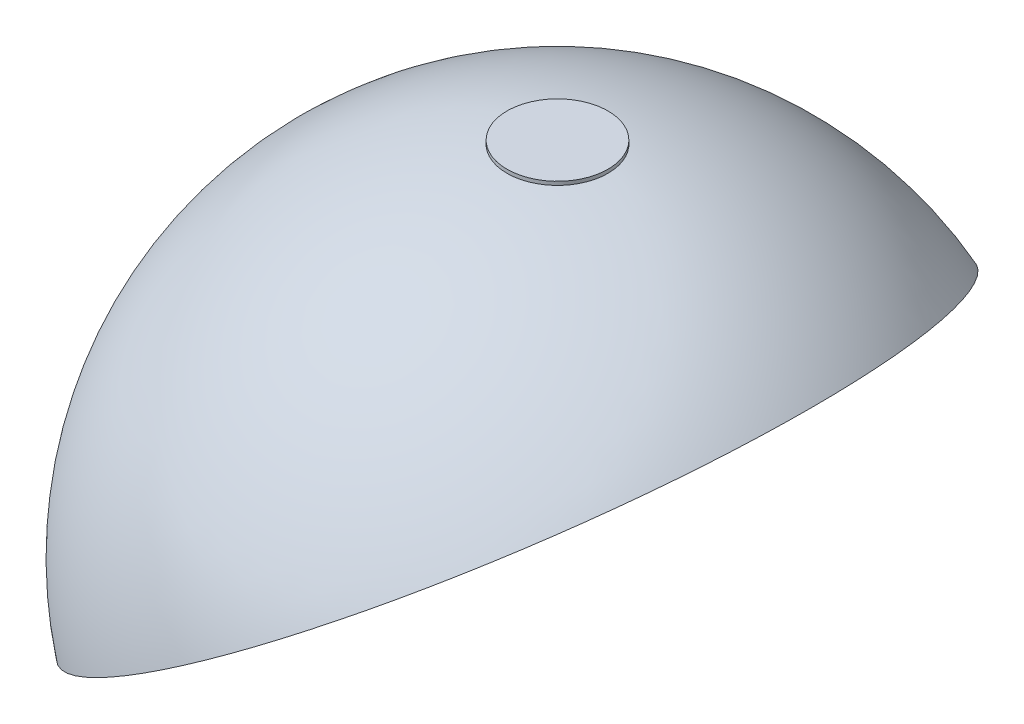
ISO-10303-21;
HEADER;
FILE_DESCRIPTION(('STEP AP214'),'2;1');
FILE_NAME('part.step','',(''),(''),'','','');
FILE_SCHEMA(('AUTOMOTIVE_DESIGN { 1 0 10303 214 1 1 1 1 }'));
ENDSEC;
DATA;
#1=APPLICATION_CONTEXT('core data for automotive mechanical design processes');
#2=APPLICATION_PROTOCOL_DEFINITION('international standard','automotive_design',2000,#1);
#3=PRODUCT_CONTEXT('',#1,'mechanical');
#4=PRODUCT('Part','Part','',(#3));
#5=PRODUCT_RELATED_PRODUCT_CATEGORY('part','',(#4));
#6=PRODUCT_DEFINITION_FORMATION('','',#4);
#7=PRODUCT_DEFINITION_CONTEXT('part definition',#1,'design');
#8=PRODUCT_DEFINITION('design','',#6,#7);
#9=PRODUCT_DEFINITION_SHAPE('','',#8);
#10=(LENGTH_UNIT() NAMED_UNIT(*) SI_UNIT(.MILLI.,.METRE.));
#11=(NAMED_UNIT(*) PLANE_ANGLE_UNIT() SI_UNIT($,.RADIAN.));
#12=(NAMED_UNIT(*) SI_UNIT($,.STERADIAN.) SOLID_ANGLE_UNIT());
#13=UNCERTAINTY_MEASURE_WITH_UNIT(LENGTH_MEASURE(1.E-05),#10,'distance_accuracy_value','');
#14=(GEOMETRIC_REPRESENTATION_CONTEXT(3) GLOBAL_UNCERTAINTY_ASSIGNED_CONTEXT((#13)) GLOBAL_UNIT_ASSIGNED_CONTEXT((#10,
#11,#12)) REPRESENTATION_CONTEXT('',''));
#15=CARTESIAN_POINT('',(0.,0.,0.));
#16=DIRECTION('',(0.,0.,1.));
#17=DIRECTION('',(1.,0.,0.));
#18=AXIS2_PLACEMENT_3D('',#15,#16,#17);
#19=CARTESIAN_POINT('',(0.,0.,0.));
#20=DIRECTION('',(-0.556232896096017,0.831026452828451,0.));
#21=DIRECTION('',(0.831026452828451,0.556232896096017,0.));
#22=AXIS2_PLACEMENT_3D('',#19,#20,#21);
#23=SPHERICAL_SURFACE('',#22,50.);
#24=CARTESIAN_POINT('',(-5.56232896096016,8.3102645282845,0.));
#25=DIRECTION('',(-0.556232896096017,0.831026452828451,0.));
#26=DIRECTION('',(-0.831026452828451,-0.556232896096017,0.));
#27=AXIS2_PLACEMENT_3D('',#24,#25,#26);
#28=CIRCLE('',#27,48.9897948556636);
#29=CARTESIAN_POINT('',(-46.2741444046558,-18.939470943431,0.));
#30=VERTEX_POINT('',#29);
#31=EDGE_CURVE('E79',#30,#30,#28,.T.);
#32=ORIENTED_EDGE('',*,*,#31,.T.);
#33=EDGE_LOOP('',(#32));
#34=FACE_BOUND('',#33,.T.);
#35=CARTESIAN_POINT('',(0.,49.5103077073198,0.));
#36=DIRECTION('',(0.,-1.,0.));
#37=DIRECTION('',(0.,0.,-1.));
#38=AXIS2_PLACEMENT_3D('',#35,#36,#37);
#39=CIRCLE('',#38,6.98064687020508);
#40=CARTESIAN_POINT('',(0.,49.5103077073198,-6.98064687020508));
#41=VERTEX_POINT('',#40);
#42=EDGE_CURVE('E11',#41,#41,#39,.F.);
#43=ORIENTED_EDGE('',*,*,#42,.F.);
#44=EDGE_LOOP('',(#43));
#45=FACE_BOUND('',#44,.T.);
#46=ADVANCED_FACE('F37',(#34,#45),#23,.T.);
#47=CARTESIAN_POINT('',(-23.9180145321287,35.7341374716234,0.));
#48=DIRECTION('',(0.556232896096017,-0.831026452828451,0.));
#49=DIRECTION('',(0.831026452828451,0.556232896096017,0.));
#50=AXIS2_PLACEMENT_3D('',#47,#48,#49);
#51=CONICAL_SURFACE('',#50,0.,1.39372087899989);
#52=CARTESIAN_POINT('',(-22.4336934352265,33.5165230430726,0.));
#53=DIRECTION('',(-0.556232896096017,0.831026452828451,0.));
#54=DIRECTION('',(-0.831026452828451,-0.556232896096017,0.));
#55=AXIS2_PLACEMENT_3D('',#52,#53,#54);
#56=CIRCLE('',#55,14.9121454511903);
#57=CARTESIAN_POINT('',(-34.8260807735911,25.221897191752,0.));
#58=VERTEX_POINT('',#57);
#59=EDGE_CURVE('E43',#58,#58,#56,.T.);
#60=ORIENTED_EDGE('',*,*,#59,.F.);
#61=EDGE_LOOP('',(#60));
#62=FACE_BOUND('',#61,.T.);
#63=CARTESIAN_POINT('',(-23.9180145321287,35.7341374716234,0.));
#64=VERTEX_POINT('',#63);
#65=VERTEX_LOOP('',#64);
#66=FACE_BOUND('',#65,.T.);
#67=ADVANCED_FACE('F46',(#62,#66),#51,.F.);
#68=CARTESIAN_POINT('',(-22.4336934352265,33.5165230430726,0.));
#69=DIRECTION('',(0.556232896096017,-0.831026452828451,0.));
#70=DIRECTION('',(0.831026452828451,0.556232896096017,0.));
#71=AXIS2_PLACEMENT_3D('',#68,#69,#70);
#72=CONICAL_SURFACE('',#71,14.9121454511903,0.964727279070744);
#73=CARTESIAN_POINT('',(-12.0598826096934,18.017779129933,0.));
#74=DIRECTION('',(-0.556232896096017,0.831026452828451,0.));
#75=DIRECTION('',(-0.831026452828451,-0.556232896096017,0.));
#76=AXIS2_PLACEMENT_3D('',#73,#74,#75);
#77=CIRCLE('',#76,41.821047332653);
#78=CARTESIAN_POINT('',(-46.8142792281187,-5.24446314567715,0.));
#79=VERTEX_POINT('',#78);
#80=EDGE_CURVE('E87',#79,#79,#77,.T.);
#81=ORIENTED_EDGE('',*,*,#80,.F.);
#82=EDGE_LOOP('',(#81));
#83=FACE_BOUND('',#82,.T.);
#84=ORIENTED_EDGE('',*,*,#59,.T.);
#85=EDGE_LOOP('',(#84));
#86=FACE_BOUND('',#85,.T.);
#87=ADVANCED_FACE('F48',(#83,#86),#72,.F.);
#88=CARTESIAN_POINT('',(-27.8116448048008,41.5513226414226,0.));
#89=DIRECTION('',(-0.556232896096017,0.831026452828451,0.));
#90=DIRECTION('',(-0.831026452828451,-0.556232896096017,0.));
#91=AXIS2_PLACEMENT_3D('',#88,#89,#90);
#92=CYLINDRICAL_SURFACE('',#91,41.821047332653);
#93=CARTESIAN_POINT('',(-5.56232896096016,8.3102645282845,0.));
#94=DIRECTION('',(-0.556232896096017,0.831026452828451,0.));
#95=DIRECTION('',(-0.831026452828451,-0.556232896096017,0.));
#96=AXIS2_PLACEMENT_3D('',#93,#94,#95);
#97=CIRCLE('',#96,41.821047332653);
#98=CARTESIAN_POINT('',(-40.3167255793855,-14.9519777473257,0.));
#99=VERTEX_POINT('',#98);
#100=EDGE_CURVE('E82',#99,#99,#97,.T.);
#101=ORIENTED_EDGE('',*,*,#100,.F.);
#102=EDGE_LOOP('',(#101));
#103=FACE_BOUND('',#102,.T.);
#104=ORIENTED_EDGE('',*,*,#80,.T.);
#105=EDGE_LOOP('',(#104));
#106=FACE_BOUND('',#105,.T.);
#107=ADVANCED_FACE('F53',(#103,#106),#92,.F.);
#108=CARTESIAN_POINT('',(35.1494864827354,35.56,0.));
#109=DIRECTION('',(-0.556232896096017,0.831026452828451,0.));
#110=DIRECTION('',(-0.831026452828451,-0.556232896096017,0.));
#111=AXIS2_PLACEMENT_3D('',#108,#109,#110);
#112=PLANE('',#111);
#113=ORIENTED_EDGE('',*,*,#31,.F.);
#114=EDGE_LOOP('',(#113));
#115=FACE_BOUND('',#114,.T.);
#116=ORIENTED_EDGE('',*,*,#100,.T.);
#117=EDGE_LOOP('',(#116));
#118=FACE_BOUND('',#117,.T.);
#119=ADVANCED_FACE('F62',(#115,#118),#112,.F.);
#120=CARTESIAN_POINT('',(0.,50.0049895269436,0.));
#121=DIRECTION('',(0.,1.,0.));
#122=DIRECTION('',(0.,0.,1.));
#123=AXIS2_PLACEMENT_3D('',#120,#121,#122);
#124=CYLINDRICAL_SURFACE('',#123,6.98064687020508);
#125=CARTESIAN_POINT('',(0.,50.0049895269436,0.));
#126=DIRECTION('',(0.,1.,0.));
#127=DIRECTION('',(0.,0.,1.));
#128=AXIS2_PLACEMENT_3D('',#125,#126,#127);
#129=CIRCLE('',#128,6.98064687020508);
#130=CARTESIAN_POINT('',(0.,50.0049895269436,6.98064687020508));
#131=VERTEX_POINT('',#130);
#132=EDGE_CURVE('E78',#131,#131,#129,.T.);
#133=ORIENTED_EDGE('',*,*,#132,.F.);
#134=EDGE_LOOP('',(#133));
#135=FACE_BOUND('',#134,.T.);
#136=ORIENTED_EDGE('',*,*,#42,.T.);
#137=EDGE_LOOP('',(#136));
#138=FACE_BOUND('',#137,.T.);
#139=ADVANCED_FACE('F66',(#135,#138),#124,.T.);
#140=CARTESIAN_POINT('',(6.98064687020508,50.0049895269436,0.));
#141=DIRECTION('',(0.,-1.,0.));
#142=DIRECTION('',(0.,0.,-1.));
#143=AXIS2_PLACEMENT_3D('',#140,#141,#142);
#144=PLANE('',#143);
#145=ORIENTED_EDGE('',*,*,#132,.T.);
#146=EDGE_LOOP('',(#145));
#147=FACE_BOUND('',#146,.T.);
#148=ADVANCED_FACE('F70',(#147),#144,.F.);
#149=CLOSED_SHELL('',(#46,#67,#87,#107,#119,#139,#148));
#150=MANIFOLD_SOLID_BREP('B2',#149);
#151=ADVANCED_BREP_SHAPE_REPRESENTATION('',(#18,#150),#14);
#152=SHAPE_DEFINITION_REPRESENTATION(#9,#151);
ENDSEC;
END-ISO-10303-21;
